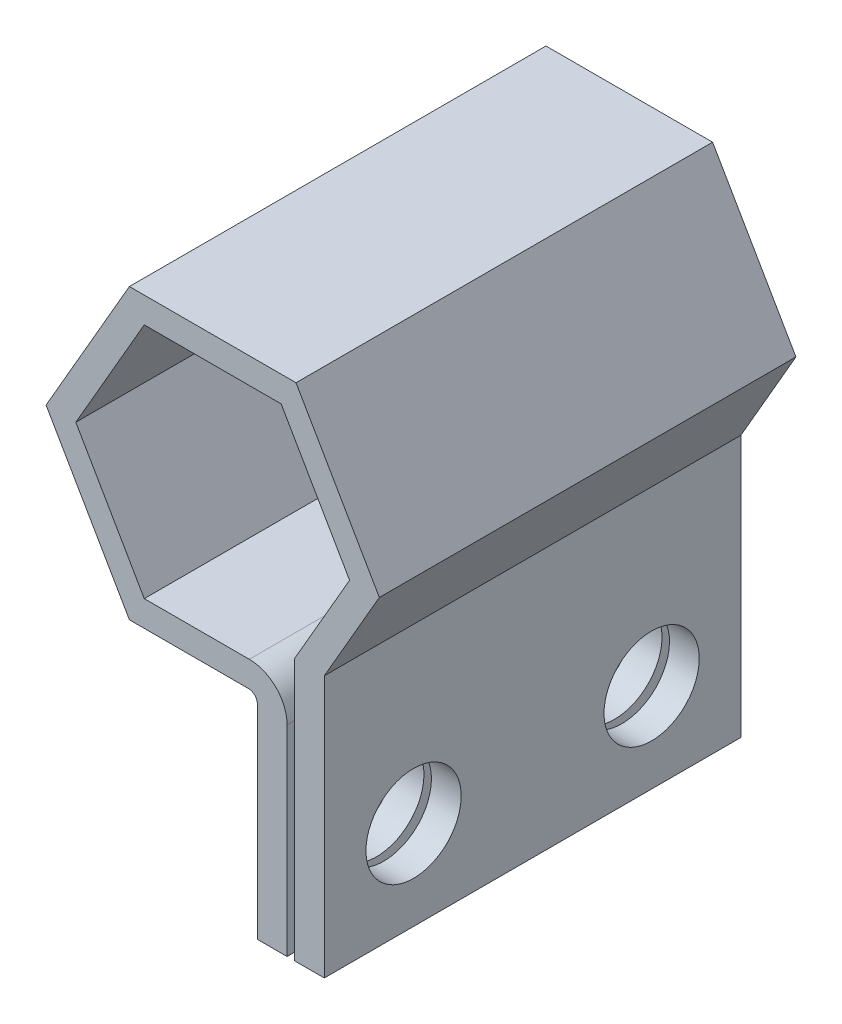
ISO-10303-21;
HEADER;
FILE_DESCRIPTION(('STEP AP214'),'2;1');
FILE_NAME('part.step','',(''),(''),'','','');
FILE_SCHEMA(('AUTOMOTIVE_DESIGN { 1 0 10303 214 1 1 1 1 }'));
ENDSEC;
DATA;
#1=APPLICATION_CONTEXT('core data for automotive mechanical design processes');
#2=APPLICATION_PROTOCOL_DEFINITION('international standard','automotive_design',2000,#1);
#3=PRODUCT_CONTEXT('',#1,'mechanical');
#4=PRODUCT('Part','Part','',(#3));
#5=PRODUCT_RELATED_PRODUCT_CATEGORY('part','',(#4));
#6=PRODUCT_DEFINITION_FORMATION('','',#4);
#7=PRODUCT_DEFINITION_CONTEXT('part definition',#1,'design');
#8=PRODUCT_DEFINITION('design','',#6,#7);
#9=PRODUCT_DEFINITION_SHAPE('','',#8);
#10=(LENGTH_UNIT() NAMED_UNIT(*) SI_UNIT(.MILLI.,.METRE.));
#11=(NAMED_UNIT(*) PLANE_ANGLE_UNIT() SI_UNIT($,.RADIAN.));
#12=(NAMED_UNIT(*) SI_UNIT($,.STERADIAN.) SOLID_ANGLE_UNIT());
#13=UNCERTAINTY_MEASURE_WITH_UNIT(LENGTH_MEASURE(1.E-05),#10,'distance_accuracy_value','');
#14=(GEOMETRIC_REPRESENTATION_CONTEXT(3) GLOBAL_UNCERTAINTY_ASSIGNED_CONTEXT((#13)) GLOBAL_UNIT_ASSIGNED_CONTEXT((#10,
#11,#12)) REPRESENTATION_CONTEXT('',''));
#15=CARTESIAN_POINT('',(0.,0.,0.));
#16=DIRECTION('',(0.,0.,1.));
#17=DIRECTION('',(1.,0.,0.));
#18=AXIS2_PLACEMENT_3D('',#15,#16,#17);
#19=CARTESIAN_POINT('',(1.23,-5.25371685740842,14.));
#20=DIRECTION('',(0.,0.,-1.));
#21=DIRECTION('',(-1.,0.,0.));
#22=AXIS2_PLACEMENT_3D('',#19,#20,#21);
#23=CYLINDRICAL_SURFACE('',#22,1.27);
#24=CARTESIAN_POINT('',(1.23,-5.25371685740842,0.));
#25=DIRECTION('',(0.,0.,1.));
#26=DIRECTION('',(1.,0.,0.));
#27=AXIS2_PLACEMENT_3D('',#24,#25,#26);
#28=CIRCLE('',#27,1.27);
#29=CARTESIAN_POINT('',(1.22999999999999,-3.98371685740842,0.));
#30=VERTEX_POINT('',#29);
#31=CARTESIAN_POINT('',(2.5,-5.25371685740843,0.));
#32=VERTEX_POINT('',#31);
#33=EDGE_CURVE('E201',#30,#32,#28,.F.);
#34=ORIENTED_EDGE('',*,*,#33,.F.);
#35=DIRECTION('',(0.,0.,-1.));
#36=VECTOR('',#35,1.);
#37=CARTESIAN_POINT('',(1.22999999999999,-3.98371685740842,14.));
#38=LINE('',#37,#36);
#39=CARTESIAN_POINT('',(1.22999999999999,-3.98371685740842,14.));
#40=VERTEX_POINT('',#39);
#41=EDGE_CURVE('E11',#40,#30,#38,.T.);
#42=ORIENTED_EDGE('',*,*,#41,.F.);
#43=CARTESIAN_POINT('',(1.23,-5.25371685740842,14.));
#44=DIRECTION('',(0.,0.,1.));
#45=DIRECTION('',(1.,0.,0.));
#46=AXIS2_PLACEMENT_3D('',#43,#44,#45);
#47=CIRCLE('',#46,1.27);
#48=CARTESIAN_POINT('',(2.5,-5.25371685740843,14.));
#49=VERTEX_POINT('',#48);
#50=EDGE_CURVE('E251',#40,#49,#47,.F.);
#51=ORIENTED_EDGE('',*,*,#50,.T.);
#52=DIRECTION('',(0.,0.,-1.));
#53=VECTOR('',#52,1.);
#54=CARTESIAN_POINT('',(2.5,-5.25371685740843,14.));
#55=LINE('',#54,#53);
#56=EDGE_CURVE('E52',#49,#32,#55,.T.);
#57=ORIENTED_EDGE('',*,*,#56,.T.);
#58=EDGE_LOOP('',(#34,#42,#51,#57));
#59=FACE_BOUND('',#58,.T.);
#60=ADVANCED_FACE('F34',(#59),#23,.T.);
#61=CARTESIAN_POINT('',(0.,-3.98371685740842,14.));
#62=DIRECTION('',(0.,1.,0.));
#63=DIRECTION('',(-1.,0.,0.));
#64=AXIS2_PLACEMENT_3D('',#61,#62,#63);
#65=PLANE('',#64);
#66=DIRECTION('',(1.,0.,0.));
#67=VECTOR('',#66,1.);
#68=CARTESIAN_POINT('',(0.,-3.98371685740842,0.));
#69=LINE('',#68,#67);
#70=CARTESIAN_POINT('',(-2.3,-3.98371685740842,0.));
#71=VERTEX_POINT('',#70);
#72=EDGE_CURVE('E203',#71,#30,#69,.T.);
#73=ORIENTED_EDGE('',*,*,#72,.F.);
#74=DIRECTION('',(0.,0.,-1.));
#75=VECTOR('',#74,1.);
#76=CARTESIAN_POINT('',(-2.3,-3.98371685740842,14.));
#77=LINE('',#76,#75);
#78=CARTESIAN_POINT('',(-2.3,-3.98371685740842,14.));
#79=VERTEX_POINT('',#78);
#80=EDGE_CURVE('E43',#79,#71,#77,.T.);
#81=ORIENTED_EDGE('',*,*,#80,.F.);
#82=DIRECTION('',(1.,0.,0.));
#83=VECTOR('',#82,1.);
#84=CARTESIAN_POINT('',(0.,-3.98371685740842,14.));
#85=LINE('',#84,#83);
#86=EDGE_CURVE('E308',#79,#40,#85,.T.);
#87=ORIENTED_EDGE('',*,*,#86,.T.);
#88=ORIENTED_EDGE('',*,*,#41,.T.);
#89=EDGE_LOOP('',(#73,#81,#87,#88));
#90=FACE_BOUND('',#89,.T.);
#91=ADVANCED_FACE('F371',(#90),#65,.T.);
#92=CARTESIAN_POINT('',(-3.45,-1.99185842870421,14.));
#93=DIRECTION('',(0.866025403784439,0.5,0.));
#94=DIRECTION('',(-0.5,0.866025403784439,0.));
#95=AXIS2_PLACEMENT_3D('',#92,#93,#94);
#96=PLANE('',#95);
#97=DIRECTION('',(0.5,-0.866025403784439,0.));
#98=VECTOR('',#97,1.);
#99=CARTESIAN_POINT('',(-3.45,-1.99185842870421,0.));
#100=LINE('',#99,#98);
#101=CARTESIAN_POINT('',(-4.6,0.,0.));
#102=VERTEX_POINT('',#101);
#103=EDGE_CURVE('E207',#102,#71,#100,.T.);
#104=ORIENTED_EDGE('',*,*,#103,.F.);
#105=DIRECTION('',(0.,0.,-1.));
#106=VECTOR('',#105,1.);
#107=CARTESIAN_POINT('',(-4.6,0.,14.));
#108=LINE('',#107,#106);
#109=CARTESIAN_POINT('',(-4.6,0.,14.));
#110=VERTEX_POINT('',#109);
#111=EDGE_CURVE('E287',#110,#102,#108,.T.);
#112=ORIENTED_EDGE('',*,*,#111,.F.);
#113=DIRECTION('',(0.5,-0.866025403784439,0.));
#114=VECTOR('',#113,1.);
#115=CARTESIAN_POINT('',(-3.45,-1.99185842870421,14.));
#116=LINE('',#115,#114);
#117=EDGE_CURVE('E311',#110,#79,#116,.T.);
#118=ORIENTED_EDGE('',*,*,#117,.T.);
#119=ORIENTED_EDGE('',*,*,#80,.T.);
#120=EDGE_LOOP('',(#104,#112,#118,#119));
#121=FACE_BOUND('',#120,.T.);
#122=ADVANCED_FACE('F375',(#121),#96,.T.);
#123=CARTESIAN_POINT('',(-3.45,1.99185842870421,14.));
#124=DIRECTION('',(0.866025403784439,-0.5,0.));
#125=DIRECTION('',(0.5,0.866025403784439,0.));
#126=AXIS2_PLACEMENT_3D('',#123,#124,#125);
#127=PLANE('',#126);
#128=DIRECTION('',(-0.5,-0.866025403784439,0.));
#129=VECTOR('',#128,1.);
#130=CARTESIAN_POINT('',(-3.45,1.99185842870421,0.));
#131=LINE('',#130,#129);
#132=CARTESIAN_POINT('',(-2.3,3.98371685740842,0.));
#133=VERTEX_POINT('',#132);
#134=EDGE_CURVE('E210',#133,#102,#131,.T.);
#135=ORIENTED_EDGE('',*,*,#134,.F.);
#136=DIRECTION('',(0.,0.,-1.));
#137=VECTOR('',#136,1.);
#138=CARTESIAN_POINT('',(-2.3,3.98371685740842,14.));
#139=LINE('',#138,#137);
#140=CARTESIAN_POINT('',(-2.3,3.98371685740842,14.));
#141=VERTEX_POINT('',#140);
#142=EDGE_CURVE('E285',#141,#133,#139,.T.);
#143=ORIENTED_EDGE('',*,*,#142,.F.);
#144=DIRECTION('',(-0.5,-0.866025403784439,0.));
#145=VECTOR('',#144,1.);
#146=CARTESIAN_POINT('',(-3.45,1.99185842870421,14.));
#147=LINE('',#146,#145);
#148=EDGE_CURVE('E314',#141,#110,#147,.T.);
#149=ORIENTED_EDGE('',*,*,#148,.T.);
#150=ORIENTED_EDGE('',*,*,#111,.T.);
#151=EDGE_LOOP('',(#135,#143,#149,#150));
#152=FACE_BOUND('',#151,.T.);
#153=ADVANCED_FACE('F385',(#152),#127,.T.);
#154=CARTESIAN_POINT('',(0.,3.98371685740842,14.));
#155=DIRECTION('',(0.,-1.,0.));
#156=DIRECTION('',(0.,0.,-1.));
#157=AXIS2_PLACEMENT_3D('',#154,#155,#156);
#158=PLANE('',#157);
#159=DIRECTION('',(-1.,0.,0.));
#160=VECTOR('',#159,1.);
#161=CARTESIAN_POINT('',(0.,3.98371685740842,0.));
#162=LINE('',#161,#160);
#163=CARTESIAN_POINT('',(2.3,3.98371685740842,0.));
#164=VERTEX_POINT('',#163);
#165=EDGE_CURVE('E213',#164,#133,#162,.T.);
#166=ORIENTED_EDGE('',*,*,#165,.F.);
#167=DIRECTION('',(0.,0.,-1.));
#168=VECTOR('',#167,1.);
#169=CARTESIAN_POINT('',(2.3,3.98371685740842,14.));
#170=LINE('',#169,#168);
#171=CARTESIAN_POINT('',(2.3,3.98371685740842,14.));
#172=VERTEX_POINT('',#171);
#173=EDGE_CURVE('E283',#172,#164,#170,.T.);
#174=ORIENTED_EDGE('',*,*,#173,.F.);
#175=DIRECTION('',(-1.,0.,0.));
#176=VECTOR('',#175,1.);
#177=CARTESIAN_POINT('',(0.,3.98371685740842,14.));
#178=LINE('',#177,#176);
#179=EDGE_CURVE('E317',#172,#141,#178,.T.);
#180=ORIENTED_EDGE('',*,*,#179,.T.);
#181=ORIENTED_EDGE('',*,*,#142,.T.);
#182=EDGE_LOOP('',(#166,#174,#180,#181));
#183=FACE_BOUND('',#182,.T.);
#184=ADVANCED_FACE('F390',(#183),#158,.T.);
#185=CARTESIAN_POINT('',(3.45,1.99185842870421,14.));
#186=DIRECTION('',(-0.866025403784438,-0.5,0.));
#187=DIRECTION('',(0.5,-0.866025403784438,0.));
#188=AXIS2_PLACEMENT_3D('',#185,#186,#187);
#189=PLANE('',#188);
#190=DIRECTION('',(-0.5,0.866025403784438,0.));
#191=VECTOR('',#190,1.);
#192=CARTESIAN_POINT('',(3.45,1.99185842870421,0.));
#193=LINE('',#192,#191);
#194=CARTESIAN_POINT('',(4.6,0.,0.));
#195=VERTEX_POINT('',#194);
#196=EDGE_CURVE('E216',#195,#164,#193,.T.);
#197=ORIENTED_EDGE('',*,*,#196,.F.);
#198=DIRECTION('',(0.,0.,-1.));
#199=VECTOR('',#198,1.);
#200=CARTESIAN_POINT('',(4.6,0.,14.));
#201=LINE('',#200,#199);
#202=CARTESIAN_POINT('',(4.6,0.,14.));
#203=VERTEX_POINT('',#202);
#204=EDGE_CURVE('E281',#203,#195,#201,.T.);
#205=ORIENTED_EDGE('',*,*,#204,.F.);
#206=DIRECTION('',(-0.5,0.866025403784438,0.));
#207=VECTOR('',#206,1.);
#208=CARTESIAN_POINT('',(3.45,1.99185842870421,14.));
#209=LINE('',#208,#207);
#210=EDGE_CURVE('E320',#203,#172,#209,.T.);
#211=ORIENTED_EDGE('',*,*,#210,.T.);
#212=ORIENTED_EDGE('',*,*,#173,.T.);
#213=EDGE_LOOP('',(#197,#205,#211,#212));
#214=FACE_BOUND('',#213,.T.);
#215=ADVANCED_FACE('F393',(#214),#189,.T.);
#216=CARTESIAN_POINT('',(3.45,-1.99185842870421,14.));
#217=DIRECTION('',(-0.866025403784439,0.499999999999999,0.));
#218=DIRECTION('',(-0.499999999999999,-0.866025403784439,0.));
#219=AXIS2_PLACEMENT_3D('',#216,#217,#218);
#220=PLANE('',#219);
#221=DIRECTION('',(0.499999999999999,0.866025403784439,0.));
#222=VECTOR('',#221,1.);
#223=CARTESIAN_POINT('',(3.45,-1.99185842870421,0.));
#224=LINE('',#223,#222);
#225=CARTESIAN_POINT('',(2.7500000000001,-3.20429399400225,0.));
#226=VERTEX_POINT('',#225);
#227=EDGE_CURVE('E219',#226,#195,#224,.T.);
#228=ORIENTED_EDGE('',*,*,#227,.F.);
#229=DIRECTION('',(0.,0.,-1.));
#230=VECTOR('',#229,1.);
#231=CARTESIAN_POINT('',(2.7500000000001,-3.20429399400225,14.));
#232=LINE('',#231,#230);
#233=CARTESIAN_POINT('',(2.7500000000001,-3.20429399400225,14.));
#234=VERTEX_POINT('',#233);
#235=EDGE_CURVE('E279',#234,#226,#232,.T.);
#236=ORIENTED_EDGE('',*,*,#235,.F.);
#237=DIRECTION('',(0.499999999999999,0.866025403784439,0.));
#238=VECTOR('',#237,1.);
#239=CARTESIAN_POINT('',(3.45,-1.99185842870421,14.));
#240=LINE('',#239,#238);
#241=EDGE_CURVE('E323',#234,#203,#240,.T.);
#242=ORIENTED_EDGE('',*,*,#241,.T.);
#243=ORIENTED_EDGE('',*,*,#204,.T.);
#244=EDGE_LOOP('',(#228,#236,#242,#243));
#245=FACE_BOUND('',#244,.T.);
#246=ADVANCED_FACE('F397',(#245),#220,.T.);
#247=CARTESIAN_POINT('',(2.75000000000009,0.,14.));
#248=DIRECTION('',(1.,0.,0.));
#249=DIRECTION('',(0.,1.,0.));
#250=AXIS2_PLACEMENT_3D('',#247,#248,#249);
#251=PLANE('',#250);
#252=CARTESIAN_POINT('',(2.75000000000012,-8.99999999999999,3.));
#253=DIRECTION('',(1.,0.,0.));
#254=DIRECTION('',(0.,1.,0.));
#255=AXIS2_PLACEMENT_3D('',#252,#253,#254);
#256=CIRCLE('',#255,1.6);
#257=CARTESIAN_POINT('',(2.75000000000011,-7.39999999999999,3.));
#258=VERTEX_POINT('',#257);
#259=EDGE_CURVE('E302',#258,#258,#256,.T.);
#260=ORIENTED_EDGE('',*,*,#259,.T.);
#261=EDGE_LOOP('',(#260));
#262=FACE_BOUND('',#261,.T.);
#263=CARTESIAN_POINT('',(2.75000000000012,-8.99999999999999,11.));
#264=DIRECTION('',(1.,0.,0.));
#265=DIRECTION('',(0.,1.,0.));
#266=AXIS2_PLACEMENT_3D('',#263,#264,#265);
#267=CIRCLE('',#266,1.6);
#268=CARTESIAN_POINT('',(2.75000000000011,-7.39999999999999,11.));
#269=VERTEX_POINT('',#268);
#270=EDGE_CURVE('E204',#269,#269,#267,.T.);
#271=ORIENTED_EDGE('',*,*,#270,.T.);
#272=EDGE_LOOP('',(#271));
#273=FACE_BOUND('',#272,.T.);
#274=DIRECTION('',(0.,-1.,0.));
#275=VECTOR('',#274,1.);
#276=CARTESIAN_POINT('',(2.75000000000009,0.,0.));
#277=LINE('',#276,#275);
#278=CARTESIAN_POINT('',(2.75000000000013,-12.,0.));
#279=VERTEX_POINT('',#278);
#280=EDGE_CURVE('E222',#226,#279,#277,.T.);
#281=ORIENTED_EDGE('',*,*,#280,.T.);
#282=DIRECTION('',(0.,0.,-1.));
#283=VECTOR('',#282,1.);
#284=CARTESIAN_POINT('',(2.75000000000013,-12.,14.));
#285=LINE('',#284,#283);
#286=CARTESIAN_POINT('',(2.75000000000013,-12.,14.));
#287=VERTEX_POINT('',#286);
#288=EDGE_CURVE('E277',#287,#279,#285,.T.);
#289=ORIENTED_EDGE('',*,*,#288,.F.);
#290=DIRECTION('',(0.,-1.,0.));
#291=VECTOR('',#290,1.);
#292=CARTESIAN_POINT('',(2.75000000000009,0.,14.));
#293=LINE('',#292,#291);
#294=EDGE_CURVE('E326',#234,#287,#293,.T.);
#295=ORIENTED_EDGE('',*,*,#294,.F.);
#296=ORIENTED_EDGE('',*,*,#235,.T.);
#297=EDGE_LOOP('',(#281,#289,#295,#296));
#298=FACE_BOUND('',#297,.T.);
#299=ADVANCED_FACE('F402',(#262,#273,#298),#251,.F.);
#300=CARTESIAN_POINT('',(0.,-12.,14.));
#301=DIRECTION('',(0.,-1.,0.));
#302=DIRECTION('',(1.,0.,0.));
#303=AXIS2_PLACEMENT_3D('',#300,#301,#302);
#304=PLANE('',#303);
#305=DIRECTION('',(-1.,0.,0.));
#306=VECTOR('',#305,1.);
#307=CARTESIAN_POINT('',(0.,-12.,0.));
#308=LINE('',#307,#306);
#309=CARTESIAN_POINT('',(3.75,-12.,0.));
#310=VERTEX_POINT('',#309);
#311=EDGE_CURVE('E225',#310,#279,#308,.T.);
#312=ORIENTED_EDGE('',*,*,#311,.F.);
#313=DIRECTION('',(0.,0.,-1.));
#314=VECTOR('',#313,1.);
#315=CARTESIAN_POINT('',(3.75,-12.,14.));
#316=LINE('',#315,#314);
#317=CARTESIAN_POINT('',(3.75,-12.,14.));
#318=VERTEX_POINT('',#317);
#319=EDGE_CURVE('E275',#318,#310,#316,.T.);
#320=ORIENTED_EDGE('',*,*,#319,.F.);
#321=DIRECTION('',(-1.,0.,0.));
#322=VECTOR('',#321,1.);
#323=CARTESIAN_POINT('',(0.,-12.,14.));
#324=LINE('',#323,#322);
#325=EDGE_CURVE('E328',#318,#287,#324,.T.);
#326=ORIENTED_EDGE('',*,*,#325,.T.);
#327=ORIENTED_EDGE('',*,*,#288,.T.);
#328=EDGE_LOOP('',(#312,#320,#326,#327));
#329=FACE_BOUND('',#328,.T.);
#330=ADVANCED_FACE('F433',(#329),#304,.T.);
#331=CARTESIAN_POINT('',(3.75000000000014,0.,14.));
#332=DIRECTION('',(1.,0.,0.));
#333=DIRECTION('',(0.,1.,0.));
#334=AXIS2_PLACEMENT_3D('',#331,#332,#333);
#335=PLANE('',#334);
#336=CARTESIAN_POINT('',(3.75000000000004,-9.,3.));
#337=DIRECTION('',(1.,0.,0.));
#338=DIRECTION('',(0.,1.,0.));
#339=AXIS2_PLACEMENT_3D('',#336,#337,#338);
#340=CIRCLE('',#339,1.6);
#341=CARTESIAN_POINT('',(3.75000000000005,-7.4,3.));
#342=VERTEX_POINT('',#341);
#343=EDGE_CURVE('E620',#342,#342,#340,.T.);
#344=ORIENTED_EDGE('',*,*,#343,.F.);
#345=EDGE_LOOP('',(#344));
#346=FACE_BOUND('',#345,.T.);
#347=CARTESIAN_POINT('',(3.75000000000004,-9.,11.));
#348=DIRECTION('',(1.,0.,0.));
#349=DIRECTION('',(0.,1.,0.));
#350=AXIS2_PLACEMENT_3D('',#347,#348,#349);
#351=CIRCLE('',#350,1.6);
#352=CARTESIAN_POINT('',(3.75000000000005,-7.4,11.));
#353=VERTEX_POINT('',#352);
#354=EDGE_CURVE('E297',#353,#353,#351,.T.);
#355=ORIENTED_EDGE('',*,*,#354,.F.);
#356=EDGE_LOOP('',(#355));
#357=FACE_BOUND('',#356,.T.);
#358=DIRECTION('',(0.,-1.,0.));
#359=VECTOR('',#358,1.);
#360=CARTESIAN_POINT('',(3.75000000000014,0.,0.));
#361=LINE('',#360,#359);
#362=CARTESIAN_POINT('',(3.7500000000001,-3.20429399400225,0.));
#363=VERTEX_POINT('',#362);
#364=EDGE_CURVE('E228',#363,#310,#361,.T.);
#365=ORIENTED_EDGE('',*,*,#364,.F.);
#366=DIRECTION('',(0.,0.,-1.));
#367=VECTOR('',#366,1.);
#368=CARTESIAN_POINT('',(3.7500000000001,-3.20429399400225,14.));
#369=LINE('',#368,#367);
#370=CARTESIAN_POINT('',(3.7500000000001,-3.20429399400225,14.));
#371=VERTEX_POINT('',#370);
#372=EDGE_CURVE('E273',#371,#363,#369,.T.);
#373=ORIENTED_EDGE('',*,*,#372,.F.);
#374=DIRECTION('',(0.,-1.,0.));
#375=VECTOR('',#374,1.);
#376=CARTESIAN_POINT('',(3.75000000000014,0.,14.));
#377=LINE('',#376,#375);
#378=EDGE_CURVE('E331',#371,#318,#377,.T.);
#379=ORIENTED_EDGE('',*,*,#378,.T.);
#380=ORIENTED_EDGE('',*,*,#319,.T.);
#381=EDGE_LOOP('',(#365,#373,#379,#380));
#382=FACE_BOUND('',#381,.T.);
#383=ADVANCED_FACE('F408',(#346,#357,#382),#335,.T.);
#384=CARTESIAN_POINT('',(4.2,-2.42487113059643,14.));
#385=DIRECTION('',(-0.866025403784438,0.5,0.));
#386=DIRECTION('',(-0.5,-0.866025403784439,0.));
#387=AXIS2_PLACEMENT_3D('',#384,#385,#386);
#388=PLANE('',#387);
#389=DIRECTION('',(0.5,0.866025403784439,0.));
#390=VECTOR('',#389,1.);
#391=CARTESIAN_POINT('',(4.2,-2.42487113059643,0.));
#392=LINE('',#391,#390);
#393=CARTESIAN_POINT('',(5.6,0.,0.));
#394=VERTEX_POINT('',#393);
#395=EDGE_CURVE('E231',#363,#394,#392,.T.);
#396=ORIENTED_EDGE('',*,*,#395,.T.);
#397=DIRECTION('',(0.,0.,-1.));
#398=VECTOR('',#397,1.);
#399=CARTESIAN_POINT('',(5.6,0.,14.));
#400=LINE('',#399,#398);
#401=CARTESIAN_POINT('',(5.6,0.,14.));
#402=VERTEX_POINT('',#401);
#403=EDGE_CURVE('E270',#402,#394,#400,.T.);
#404=ORIENTED_EDGE('',*,*,#403,.F.);
#405=DIRECTION('',(0.5,0.866025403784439,0.));
#406=VECTOR('',#405,1.);
#407=CARTESIAN_POINT('',(4.2,-2.42487113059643,14.));
#408=LINE('',#407,#406);
#409=EDGE_CURVE('E334',#371,#402,#408,.T.);
#410=ORIENTED_EDGE('',*,*,#409,.F.);
#411=ORIENTED_EDGE('',*,*,#372,.T.);
#412=EDGE_LOOP('',(#396,#404,#410,#411));
#413=FACE_BOUND('',#412,.T.);
#414=ADVANCED_FACE('F414',(#413),#388,.F.);
#415=CARTESIAN_POINT('',(4.19999999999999,2.42487113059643,14.));
#416=DIRECTION('',(-0.866025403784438,-0.500000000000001,0.));
#417=DIRECTION('',(0.500000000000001,-0.866025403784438,0.));
#418=AXIS2_PLACEMENT_3D('',#415,#416,#417);
#419=PLANE('',#418);
#420=DIRECTION('',(-0.500000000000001,0.866025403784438,0.));
#421=VECTOR('',#420,1.);
#422=CARTESIAN_POINT('',(4.19999999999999,2.42487113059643,0.));
#423=LINE('',#422,#421);
#424=CARTESIAN_POINT('',(2.79999999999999,4.84974226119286,0.));
#425=VERTEX_POINT('',#424);
#426=EDGE_CURVE('E233',#394,#425,#423,.T.);
#427=ORIENTED_EDGE('',*,*,#426,.T.);
#428=DIRECTION('',(0.,0.,-1.));
#429=VECTOR('',#428,1.);
#430=CARTESIAN_POINT('',(2.79999999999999,4.84974226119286,14.));
#431=LINE('',#430,#429);
#432=CARTESIAN_POINT('',(2.79999999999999,4.84974226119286,14.));
#433=VERTEX_POINT('',#432);
#434=EDGE_CURVE('E267',#433,#425,#431,.T.);
#435=ORIENTED_EDGE('',*,*,#434,.F.);
#436=DIRECTION('',(-0.500000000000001,0.866025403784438,0.));
#437=VECTOR('',#436,1.);
#438=CARTESIAN_POINT('',(4.19999999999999,2.42487113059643,14.));
#439=LINE('',#438,#437);
#440=EDGE_CURVE('E336',#402,#433,#439,.T.);
#441=ORIENTED_EDGE('',*,*,#440,.F.);
#442=ORIENTED_EDGE('',*,*,#403,.T.);
#443=EDGE_LOOP('',(#427,#435,#441,#442));
#444=FACE_BOUND('',#443,.T.);
#445=ADVANCED_FACE('F420',(#444),#419,.F.);
#446=CARTESIAN_POINT('',(0.,4.84974226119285,14.));
#447=DIRECTION('',(0.,-1.,0.));
#448=DIRECTION('',(1.,0.,0.));
#449=AXIS2_PLACEMENT_3D('',#446,#447,#448);
#450=PLANE('',#449);
#451=DIRECTION('',(-1.,0.,0.));
#452=VECTOR('',#451,1.);
#453=CARTESIAN_POINT('',(0.,4.84974226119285,0.));
#454=LINE('',#453,#452);
#455=CARTESIAN_POINT('',(-2.80000000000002,4.84974226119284,0.));
#456=VERTEX_POINT('',#455);
#457=EDGE_CURVE('E235',#425,#456,#454,.T.);
#458=ORIENTED_EDGE('',*,*,#457,.T.);
#459=DIRECTION('',(0.,0.,-1.));
#460=VECTOR('',#459,1.);
#461=CARTESIAN_POINT('',(-2.80000000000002,4.84974226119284,14.));
#462=LINE('',#461,#460);
#463=CARTESIAN_POINT('',(-2.80000000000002,4.84974226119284,14.));
#464=VERTEX_POINT('',#463);
#465=EDGE_CURVE('E264',#464,#456,#462,.T.);
#466=ORIENTED_EDGE('',*,*,#465,.F.);
#467=DIRECTION('',(-1.,0.,0.));
#468=VECTOR('',#467,1.);
#469=CARTESIAN_POINT('',(0.,4.84974226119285,14.));
#470=LINE('',#469,#468);
#471=EDGE_CURVE('E338',#433,#464,#470,.T.);
#472=ORIENTED_EDGE('',*,*,#471,.F.);
#473=ORIENTED_EDGE('',*,*,#434,.T.);
#474=EDGE_LOOP('',(#458,#466,#472,#473));
#475=FACE_BOUND('',#474,.T.);
#476=ADVANCED_FACE('F424',(#475),#450,.F.);
#477=CARTESIAN_POINT('',(-4.20000000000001,2.4248711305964,14.));
#478=DIRECTION('',(0.866025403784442,-0.499999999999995,0.));
#479=DIRECTION('',(0.499999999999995,0.866025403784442,0.));
#480=AXIS2_PLACEMENT_3D('',#477,#478,#479);
#481=PLANE('',#480);
#482=DIRECTION('',(-0.499999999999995,-0.866025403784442,0.));
#483=VECTOR('',#482,1.);
#484=CARTESIAN_POINT('',(-4.20000000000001,2.4248711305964,0.));
#485=LINE('',#484,#483);
#486=CARTESIAN_POINT('',(-5.6,0.,0.));
#487=VERTEX_POINT('',#486);
#488=EDGE_CURVE('E237',#456,#487,#485,.T.);
#489=ORIENTED_EDGE('',*,*,#488,.T.);
#490=DIRECTION('',(0.,0.,-1.));
#491=VECTOR('',#490,1.);
#492=CARTESIAN_POINT('',(-5.6,0.,14.));
#493=LINE('',#492,#491);
#494=CARTESIAN_POINT('',(-5.6,0.,14.));
#495=VERTEX_POINT('',#494);
#496=EDGE_CURVE('E261',#495,#487,#493,.T.);
#497=ORIENTED_EDGE('',*,*,#496,.F.);
#498=DIRECTION('',(-0.499999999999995,-0.866025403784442,0.));
#499=VECTOR('',#498,1.);
#500=CARTESIAN_POINT('',(-4.20000000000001,2.4248711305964,14.));
#501=LINE('',#500,#499);
#502=EDGE_CURVE('E340',#464,#495,#501,.T.);
#503=ORIENTED_EDGE('',*,*,#502,.F.);
#504=ORIENTED_EDGE('',*,*,#465,.T.);
#505=EDGE_LOOP('',(#489,#497,#503,#504));
#506=FACE_BOUND('',#505,.T.);
#507=ADVANCED_FACE('F429',(#506),#481,.F.);
#508=CARTESIAN_POINT('',(-4.19999999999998,-2.42487113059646,14.));
#509=DIRECTION('',(0.866025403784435,0.500000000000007,0.));
#510=DIRECTION('',(-0.500000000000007,0.866025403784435,0.));
#511=AXIS2_PLACEMENT_3D('',#508,#509,#510);
#512=PLANE('',#511);
#513=DIRECTION('',(0.500000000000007,-0.866025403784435,0.));
#514=VECTOR('',#513,1.);
#515=CARTESIAN_POINT('',(-4.19999999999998,-2.42487113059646,0.));
#516=LINE('',#515,#514);
#517=CARTESIAN_POINT('',(-2.79999999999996,-4.84974226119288,0.));
#518=VERTEX_POINT('',#517);
#519=EDGE_CURVE('E239',#487,#518,#516,.T.);
#520=ORIENTED_EDGE('',*,*,#519,.T.);
#521=DIRECTION('',(0.,0.,-1.));
#522=VECTOR('',#521,1.);
#523=CARTESIAN_POINT('',(-2.79999999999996,-4.84974226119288,14.));
#524=LINE('',#523,#522);
#525=CARTESIAN_POINT('',(-2.79999999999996,-4.84974226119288,14.));
#526=VERTEX_POINT('',#525);
#527=EDGE_CURVE('E258',#526,#518,#524,.T.);
#528=ORIENTED_EDGE('',*,*,#527,.F.);
#529=DIRECTION('',(0.500000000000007,-0.866025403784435,0.));
#530=VECTOR('',#529,1.);
#531=CARTESIAN_POINT('',(-4.19999999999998,-2.42487113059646,14.));
#532=LINE('',#531,#530);
#533=EDGE_CURVE('E342',#495,#526,#532,.T.);
#534=ORIENTED_EDGE('',*,*,#533,.F.);
#535=ORIENTED_EDGE('',*,*,#496,.T.);
#536=EDGE_LOOP('',(#520,#528,#534,#535));
#537=FACE_BOUND('',#536,.T.);
#538=ADVANCED_FACE('F432',(#537),#512,.F.);
#539=CARTESIAN_POINT('',(0.,-4.84974226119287,14.));
#540=DIRECTION('',(0.,1.,0.));
#541=DIRECTION('',(-1.,0.,0.));
#542=AXIS2_PLACEMENT_3D('',#539,#540,#541);
#543=PLANE('',#542);
#544=DIRECTION('',(1.,0.,0.));
#545=VECTOR('',#544,1.);
#546=CARTESIAN_POINT('',(0.,-4.84974226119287,0.));
#547=LINE('',#546,#545);
#548=CARTESIAN_POINT('',(1.2,-4.84974226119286,0.));
#549=VERTEX_POINT('',#548);
#550=EDGE_CURVE('E241',#518,#549,#547,.T.);
#551=ORIENTED_EDGE('',*,*,#550,.T.);
#552=DIRECTION('',(0.,0.,-1.));
#553=VECTOR('',#552,1.);
#554=CARTESIAN_POINT('',(1.2,-4.84974226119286,14.));
#555=LINE('',#554,#553);
#556=CARTESIAN_POINT('',(1.2,-4.84974226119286,14.));
#557=VERTEX_POINT('',#556);
#558=EDGE_CURVE('E255',#557,#549,#555,.T.);
#559=ORIENTED_EDGE('',*,*,#558,.F.);
#560=DIRECTION('',(1.,0.,0.));
#561=VECTOR('',#560,1.);
#562=CARTESIAN_POINT('',(0.,-4.84974226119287,14.));
#563=LINE('',#562,#561);
#564=EDGE_CURVE('E344',#526,#557,#563,.T.);
#565=ORIENTED_EDGE('',*,*,#564,.F.);
#566=ORIENTED_EDGE('',*,*,#527,.T.);
#567=EDGE_LOOP('',(#551,#559,#565,#566));
#568=FACE_BOUND('',#567,.T.);
#569=ADVANCED_FACE('F350',(#568),#543,.F.);
#570=CARTESIAN_POINT('',(1.2,-5.14974226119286,14.));
#571=DIRECTION('',(0.,0.,-1.));
#572=DIRECTION('',(-1.,0.,0.));
#573=AXIS2_PLACEMENT_3D('',#570,#571,#572);
#574=CYLINDRICAL_SURFACE('',#573,0.3);
#575=CARTESIAN_POINT('',(1.2,-5.14974226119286,0.));
#576=DIRECTION('',(0.,0.,1.));
#577=DIRECTION('',(1.,0.,0.));
#578=AXIS2_PLACEMENT_3D('',#575,#576,#577);
#579=CIRCLE('',#578,0.3);
#580=CARTESIAN_POINT('',(1.5,-5.14974226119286,0.));
#581=VERTEX_POINT('',#580);
#582=EDGE_CURVE('E243',#549,#581,#579,.F.);
#583=ORIENTED_EDGE('',*,*,#582,.T.);
#584=DIRECTION('',(0.,0.,-1.));
#585=VECTOR('',#584,1.);
#586=CARTESIAN_POINT('',(1.5,-5.14974226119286,14.));
#587=LINE('',#586,#585);
#588=CARTESIAN_POINT('',(1.5,-5.14974226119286,14.));
#589=VERTEX_POINT('',#588);
#590=EDGE_CURVE('E193',#589,#581,#587,.T.);
#591=ORIENTED_EDGE('',*,*,#590,.F.);
#592=CARTESIAN_POINT('',(1.2,-5.14974226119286,14.));
#593=DIRECTION('',(0.,0.,1.));
#594=DIRECTION('',(1.,0.,0.));
#595=AXIS2_PLACEMENT_3D('',#592,#593,#594);
#596=CIRCLE('',#595,0.3);
#597=EDGE_CURVE('E181',#557,#589,#596,.F.);
#598=ORIENTED_EDGE('',*,*,#597,.F.);
#599=ORIENTED_EDGE('',*,*,#558,.T.);
#600=EDGE_LOOP('',(#583,#591,#598,#599));
#601=FACE_BOUND('',#600,.T.);
#602=ADVANCED_FACE('F354',(#601),#574,.F.);
#603=CARTESIAN_POINT('',(1.5,0.,14.));
#604=DIRECTION('',(1.,0.,0.));
#605=DIRECTION('',(0.,1.,0.));
#606=AXIS2_PLACEMENT_3D('',#603,#604,#605);
#607=PLANE('',#606);
#608=CARTESIAN_POINT('',(1.5,-8.99999999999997,3.));
#609=DIRECTION('',(1.,0.,0.));
#610=DIRECTION('',(0.,1.,0.));
#611=AXIS2_PLACEMENT_3D('',#608,#609,#610);
#612=CIRCLE('',#611,1.6);
#613=CARTESIAN_POINT('',(1.50000000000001,-7.39999999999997,3.));
#614=VERTEX_POINT('',#613);
#615=EDGE_CURVE('E624',#614,#614,#612,.T.);
#616=ORIENTED_EDGE('',*,*,#615,.T.);
#617=EDGE_LOOP('',(#616));
#618=FACE_BOUND('',#617,.T.);
#619=CARTESIAN_POINT('',(1.5,-8.99999999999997,11.));
#620=DIRECTION('',(1.,0.,0.));
#621=DIRECTION('',(0.,1.,0.));
#622=AXIS2_PLACEMENT_3D('',#619,#620,#621);
#623=CIRCLE('',#622,1.6);
#624=CARTESIAN_POINT('',(1.50000000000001,-7.39999999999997,11.));
#625=VERTEX_POINT('',#624);
#626=EDGE_CURVE('E291',#625,#625,#623,.T.);
#627=ORIENTED_EDGE('',*,*,#626,.T.);
#628=EDGE_LOOP('',(#627));
#629=FACE_BOUND('',#628,.T.);
#630=DIRECTION('',(0.,-1.,0.));
#631=VECTOR('',#630,1.);
#632=CARTESIAN_POINT('',(1.5,0.,0.));
#633=LINE('',#632,#631);
#634=CARTESIAN_POINT('',(1.5,-12.,0.));
#635=VERTEX_POINT('',#634);
#636=EDGE_CURVE('E190',#581,#635,#633,.T.);
#637=ORIENTED_EDGE('',*,*,#636,.T.);
#638=DIRECTION('',(0.,0.,-1.));
#639=VECTOR('',#638,1.);
#640=CARTESIAN_POINT('',(1.5,-12.,14.));
#641=LINE('',#640,#639);
#642=CARTESIAN_POINT('',(1.5,-12.,14.));
#643=VERTEX_POINT('',#642);
#644=EDGE_CURVE('E187',#643,#635,#641,.T.);
#645=ORIENTED_EDGE('',*,*,#644,.F.);
#646=DIRECTION('',(0.,-1.,0.));
#647=VECTOR('',#646,1.);
#648=CARTESIAN_POINT('',(1.5,0.,14.));
#649=LINE('',#648,#647);
#650=EDGE_CURVE('E174',#589,#643,#649,.T.);
#651=ORIENTED_EDGE('',*,*,#650,.F.);
#652=ORIENTED_EDGE('',*,*,#590,.T.);
#653=EDGE_LOOP('',(#637,#645,#651,#652));
#654=FACE_BOUND('',#653,.T.);
#655=ADVANCED_FACE('F188',(#618,#629,#654),#607,.F.);
#656=CARTESIAN_POINT('',(0.,-12.,14.));
#657=DIRECTION('',(0.,-1.,0.));
#658=DIRECTION('',(0.,0.,-1.));
#659=AXIS2_PLACEMENT_3D('',#656,#657,#658);
#660=PLANE('',#659);
#661=DIRECTION('',(-1.,0.,0.));
#662=VECTOR('',#661,1.);
#663=CARTESIAN_POINT('',(0.,-12.,0.));
#664=LINE('',#663,#662);
#665=CARTESIAN_POINT('',(2.5,-12.,0.));
#666=VERTEX_POINT('',#665);
#667=EDGE_CURVE('E246',#666,#635,#664,.T.);
#668=ORIENTED_EDGE('',*,*,#667,.F.);
#669=DIRECTION('',(0.,0.,-1.));
#670=VECTOR('',#669,1.);
#671=CARTESIAN_POINT('',(2.5,-12.,14.));
#672=LINE('',#671,#670);
#673=CARTESIAN_POINT('',(2.5,-12.,14.));
#674=VERTEX_POINT('',#673);
#675=EDGE_CURVE('E113',#674,#666,#672,.T.);
#676=ORIENTED_EDGE('',*,*,#675,.F.);
#677=DIRECTION('',(-1.,0.,0.));
#678=VECTOR('',#677,1.);
#679=CARTESIAN_POINT('',(0.,-12.,14.));
#680=LINE('',#679,#678);
#681=EDGE_CURVE('E179',#674,#643,#680,.T.);
#682=ORIENTED_EDGE('',*,*,#681,.T.);
#683=ORIENTED_EDGE('',*,*,#644,.T.);
#684=EDGE_LOOP('',(#668,#676,#682,#683));
#685=FACE_BOUND('',#684,.T.);
#686=ADVANCED_FACE('F195',(#685),#660,.T.);
#687=CARTESIAN_POINT('',(2.5,0.,14.));
#688=DIRECTION('',(1.,0.,0.));
#689=DIRECTION('',(0.,0.,-1.));
#690=AXIS2_PLACEMENT_3D('',#687,#688,#689);
#691=PLANE('',#690);
#692=CARTESIAN_POINT('',(2.5,-8.99999999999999,3.));
#693=DIRECTION('',(1.,0.,0.));
#694=DIRECTION('',(0.,0.,-1.));
#695=AXIS2_PLACEMENT_3D('',#692,#693,#694);
#696=CIRCLE('',#695,1.6);
#697=CARTESIAN_POINT('',(2.5,-8.99999999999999,1.4));
#698=VERTEX_POINT('',#697);
#699=EDGE_CURVE('E37',#698,#698,#696,.T.);
#700=ORIENTED_EDGE('',*,*,#699,.F.);
#701=EDGE_LOOP('',(#700));
#702=FACE_BOUND('',#701,.T.);
#703=CARTESIAN_POINT('',(2.5,-8.99999999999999,11.));
#704=DIRECTION('',(1.,0.,0.));
#705=DIRECTION('',(0.,0.,-1.));
#706=AXIS2_PLACEMENT_3D('',#703,#704,#705);
#707=CIRCLE('',#706,1.6);
#708=CARTESIAN_POINT('',(2.5,-8.99999999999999,9.4));
#709=VERTEX_POINT('',#708);
#710=EDGE_CURVE('E289',#709,#709,#707,.T.);
#711=ORIENTED_EDGE('',*,*,#710,.F.);
#712=EDGE_LOOP('',(#711));
#713=FACE_BOUND('',#712,.T.);
#714=DIRECTION('',(0.,-1.,0.));
#715=VECTOR('',#714,1.);
#716=CARTESIAN_POINT('',(2.5,0.,0.));
#717=LINE('',#716,#715);
#718=EDGE_CURVE('E248',#32,#666,#717,.T.);
#719=ORIENTED_EDGE('',*,*,#718,.F.);
#720=ORIENTED_EDGE('',*,*,#56,.F.);
#721=DIRECTION('',(0.,-1.,0.));
#722=VECTOR('',#721,1.);
#723=CARTESIAN_POINT('',(2.5,0.,14.));
#724=LINE('',#723,#722);
#725=EDGE_CURVE('E196',#49,#674,#724,.T.);
#726=ORIENTED_EDGE('',*,*,#725,.T.);
#727=ORIENTED_EDGE('',*,*,#675,.T.);
#728=EDGE_LOOP('',(#719,#720,#726,#727));
#729=FACE_BOUND('',#728,.T.);
#730=ADVANCED_FACE('F357',(#702,#713,#729),#691,.T.);
#731=CARTESIAN_POINT('',(0.,0.,14.));
#732=DIRECTION('',(0.,0.,1.));
#733=DIRECTION('',(1.,0.,0.));
#734=AXIS2_PLACEMENT_3D('',#731,#732,#733);
#735=PLANE('',#734);
#736=ORIENTED_EDGE('',*,*,#50,.F.);
#737=ORIENTED_EDGE('',*,*,#86,.F.);
#738=ORIENTED_EDGE('',*,*,#117,.F.);
#739=ORIENTED_EDGE('',*,*,#148,.F.);
#740=ORIENTED_EDGE('',*,*,#179,.F.);
#741=ORIENTED_EDGE('',*,*,#210,.F.);
#742=ORIENTED_EDGE('',*,*,#241,.F.);
#743=ORIENTED_EDGE('',*,*,#294,.T.);
#744=ORIENTED_EDGE('',*,*,#325,.F.);
#745=ORIENTED_EDGE('',*,*,#378,.F.);
#746=ORIENTED_EDGE('',*,*,#409,.T.);
#747=ORIENTED_EDGE('',*,*,#440,.T.);
#748=ORIENTED_EDGE('',*,*,#471,.T.);
#749=ORIENTED_EDGE('',*,*,#502,.T.);
#750=ORIENTED_EDGE('',*,*,#533,.T.);
#751=ORIENTED_EDGE('',*,*,#564,.T.);
#752=ORIENTED_EDGE('',*,*,#597,.T.);
#753=ORIENTED_EDGE('',*,*,#650,.T.);
#754=ORIENTED_EDGE('',*,*,#681,.F.);
#755=ORIENTED_EDGE('',*,*,#725,.F.);
#756=EDGE_LOOP('',(#736,#737,#738,#739,#740,#741,#742,#743,#744,#745,#746,#747,#748,#749,#750,
#751,#752,#753,#754,#755));
#757=FACE_BOUND('',#756,.T.);
#758=ADVANCED_FACE('F176',(#757),#735,.T.);
#759=CARTESIAN_POINT('',(0.,0.,0.));
#760=DIRECTION('',(0.,0.,1.));
#761=DIRECTION('',(1.,0.,0.));
#762=AXIS2_PLACEMENT_3D('',#759,#760,#761);
#763=PLANE('',#762);
#764=ORIENTED_EDGE('',*,*,#33,.T.);
#765=ORIENTED_EDGE('',*,*,#718,.T.);
#766=ORIENTED_EDGE('',*,*,#667,.T.);
#767=ORIENTED_EDGE('',*,*,#636,.F.);
#768=ORIENTED_EDGE('',*,*,#582,.F.);
#769=ORIENTED_EDGE('',*,*,#550,.F.);
#770=ORIENTED_EDGE('',*,*,#519,.F.);
#771=ORIENTED_EDGE('',*,*,#488,.F.);
#772=ORIENTED_EDGE('',*,*,#457,.F.);
#773=ORIENTED_EDGE('',*,*,#426,.F.);
#774=ORIENTED_EDGE('',*,*,#395,.F.);
#775=ORIENTED_EDGE('',*,*,#364,.T.);
#776=ORIENTED_EDGE('',*,*,#311,.T.);
#777=ORIENTED_EDGE('',*,*,#280,.F.);
#778=ORIENTED_EDGE('',*,*,#227,.T.);
#779=ORIENTED_EDGE('',*,*,#196,.T.);
#780=ORIENTED_EDGE('',*,*,#165,.T.);
#781=ORIENTED_EDGE('',*,*,#134,.T.);
#782=ORIENTED_EDGE('',*,*,#103,.T.);
#783=ORIENTED_EDGE('',*,*,#72,.T.);
#784=EDGE_LOOP('',(#764,#765,#766,#767,#768,#769,#770,#771,#772,#773,#774,#775,#776,#777,#778,
#779,#780,#781,#782,#783));
#785=FACE_BOUND('',#784,.T.);
#786=ADVANCED_FACE('F356',(#785),#763,.F.);
#787=CARTESIAN_POINT('',(1.5,-8.99999999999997,11.));
#788=DIRECTION('',(1.,0.,0.));
#789=DIRECTION('',(0.,1.,0.));
#790=AXIS2_PLACEMENT_3D('',#787,#788,#789);
#791=CYLINDRICAL_SURFACE('',#790,1.6);
#792=ORIENTED_EDGE('',*,*,#710,.T.);
#793=EDGE_LOOP('',(#792));
#794=FACE_BOUND('',#793,.T.);
#795=ORIENTED_EDGE('',*,*,#626,.F.);
#796=EDGE_LOOP('',(#795));
#797=FACE_BOUND('',#796,.T.);
#798=ADVANCED_FACE('F515',(#794,#797),#791,.F.);
#799=ORIENTED_EDGE('',*,*,#354,.T.);
#800=EDGE_LOOP('',(#799));
#801=FACE_BOUND('',#800,.T.);
#802=ORIENTED_EDGE('',*,*,#270,.F.);
#803=EDGE_LOOP('',(#802));
#804=FACE_BOUND('',#803,.T.);
#805=ADVANCED_FACE('F520',(#801,#804),#791,.F.);
#806=CARTESIAN_POINT('',(1.5,-8.99999999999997,3.));
#807=DIRECTION('',(1.,0.,0.));
#808=DIRECTION('',(0.,1.,0.));
#809=AXIS2_PLACEMENT_3D('',#806,#807,#808);
#810=CYLINDRICAL_SURFACE('',#809,1.6);
#811=ORIENTED_EDGE('',*,*,#699,.T.);
#812=EDGE_LOOP('',(#811));
#813=FACE_BOUND('',#812,.T.);
#814=ORIENTED_EDGE('',*,*,#615,.F.);
#815=EDGE_LOOP('',(#814));
#816=FACE_BOUND('',#815,.T.);
#817=ADVANCED_FACE('F529',(#813,#816),#810,.F.);
#818=ORIENTED_EDGE('',*,*,#343,.T.);
#819=EDGE_LOOP('',(#818));
#820=FACE_BOUND('',#819,.T.);
#821=ORIENTED_EDGE('',*,*,#259,.F.);
#822=EDGE_LOOP('',(#821));
#823=FACE_BOUND('',#822,.T.);
#824=ADVANCED_FACE('F538',(#820,#823),#810,.F.);
#825=CLOSED_SHELL('',(#60,#91,#122,#153,#184,#215,#246,#299,#330,#383,#414,#445,#476,#507,#538,
#569,#602,#655,#686,#730,#758,#786,#798,#805,#817,#824));
#826=MANIFOLD_SOLID_BREP('B2',#825);
#827=ADVANCED_BREP_SHAPE_REPRESENTATION('',(#18,#826),#14);
#828=SHAPE_DEFINITION_REPRESENTATION(#9,#827);
ENDSEC;
END-ISO-10303-21;
